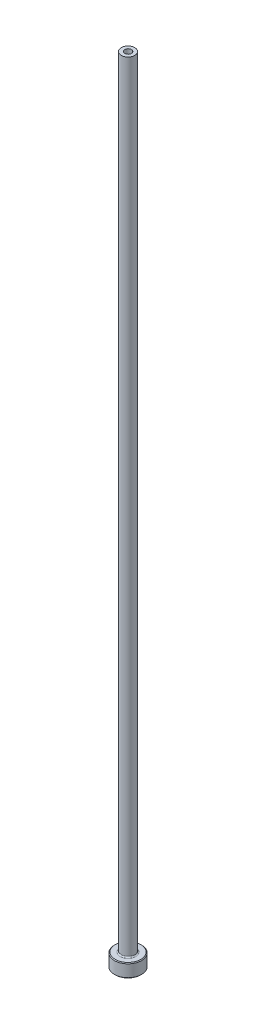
from build123d import *

# Parameters (mm, degrees)
CHAMFER1_SIZE = 0.254


with BuildPart() as part:
    # Sketch1 → Revolve1 (revolve)
    with BuildSketch(Plane.XY, mode=Mode.PRIVATE) as revolve1_sk:
        with BuildLine():
            Line((0, 0), (4.7625, 0))
            Line((4.7625, 0), (4.7625, 4.7498))
            Line((4.7625, 4.7498), (2.771775, 4.7498))
            ThreePointArc((2.771775, 4.7498), (2.491141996, 4.866041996), (2.3749, 5.146675))
            Line((2.3749, 5.146675), (2.3749, 279.4))
            Line((2.3749, 279.4), (0, 279.4))
            Line((0, 279.4), (0, 0))
        make_face()
    revolve(revolve1_sk.sketch.rotate(Axis((0, 0, 0), (0, 1, 0)), 90), axis=Axis((0, 0, 0), (0, 1, 0)))

    # Sketch2 → Cut-Revolve1 (revolve, cut)
    with BuildSketch(Plane.XY, mode=Mode.PRIVATE) as cut_revolve1_sk:
        Polygon((1.777365, 0), (1.38049, 0.396875), (1.38049, 217.6145), (1.18999, 231.902), (1.18999, 279.4), (0, 279.4), (0, 0), align=None)
    revolve(cut_revolve1_sk.sketch.rotate(Axis((0, 0, 0), (0, 1, 0)), 90), axis=Axis((0, 0, 0), (0, 1, 0)), mode=Mode.SUBTRACT)

    # Chamfer1
    chamfer1_edges = [part.edges().sort_by_distance(p)[0] for p in [
        (0, 4.7498, 4.7625),
        (0, 0, 4.7625),
    ]]
    chamfer(chamfer1_edges, length=CHAMFER1_SIZE)


solid = part.part
